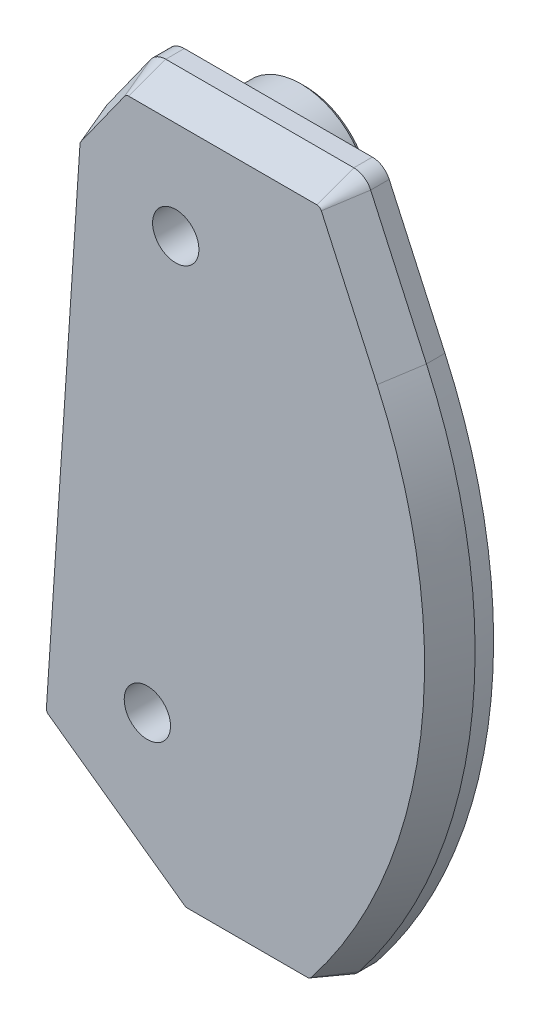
ISO-10303-21;
HEADER;
FILE_DESCRIPTION(('STEP AP214'),'2;1');
FILE_NAME('part.step','',(''),(''),'','','');
FILE_SCHEMA(('AUTOMOTIVE_DESIGN { 1 0 10303 214 1 1 1 1 }'));
ENDSEC;
DATA;
#1=APPLICATION_CONTEXT('core data for automotive mechanical design processes');
#2=APPLICATION_PROTOCOL_DEFINITION('international standard','automotive_design',2000,#1);
#3=PRODUCT_CONTEXT('',#1,'mechanical');
#4=PRODUCT('Part','Part','',(#3));
#5=PRODUCT_RELATED_PRODUCT_CATEGORY('part','',(#4));
#6=PRODUCT_DEFINITION_FORMATION('','',#4);
#7=PRODUCT_DEFINITION_CONTEXT('part definition',#1,'design');
#8=PRODUCT_DEFINITION('design','',#6,#7);
#9=PRODUCT_DEFINITION_SHAPE('','',#8);
#10=(LENGTH_UNIT() NAMED_UNIT(*) SI_UNIT(.MILLI.,.METRE.));
#11=(NAMED_UNIT(*) PLANE_ANGLE_UNIT() SI_UNIT($,.RADIAN.));
#12=(NAMED_UNIT(*) SI_UNIT($,.STERADIAN.) SOLID_ANGLE_UNIT());
#13=UNCERTAINTY_MEASURE_WITH_UNIT(LENGTH_MEASURE(1.E-05),#10,'distance_accuracy_value','');
#14=(GEOMETRIC_REPRESENTATION_CONTEXT(3) GLOBAL_UNCERTAINTY_ASSIGNED_CONTEXT((#13)) GLOBAL_UNIT_ASSIGNED_CONTEXT((#10,
#11,#12)) REPRESENTATION_CONTEXT('',''));
#15=CARTESIAN_POINT('',(0.,0.,0.));
#16=DIRECTION('',(0.,0.,1.));
#17=DIRECTION('',(1.,0.,0.));
#18=AXIS2_PLACEMENT_3D('',#15,#16,#17);
#19=CARTESIAN_POINT('',(-61.9612255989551,13.1120632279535,6.));
#20=DIRECTION('',(0.,0.,-1.));
#21=DIRECTION('',(-1.,0.,0.));
#22=AXIS2_PLACEMENT_3D('',#19,#20,#21);
#23=CYLINDRICAL_SURFACE('',#22,58.581585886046);
#24=DIRECTION('',(0.,0.,1.));
#25=VECTOR('',#24,1.);
#26=CARTESIAN_POINT('',(-8.63233537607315,37.3573034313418,-112.384243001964));
#27=LINE('',#26,#25);
#28=CARTESIAN_POINT('',(-8.63233537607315,37.3573034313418,0.));
#29=VERTEX_POINT('',#28);
#30=CARTESIAN_POINT('',(-8.63233537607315,37.3573034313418,1.99999999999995));
#31=VERTEX_POINT('',#30);
#32=EDGE_CURVE('E221',#29,#31,#27,.T.);
#33=ORIENTED_EDGE('',*,*,#32,.T.);
#34=CARTESIAN_POINT('',(-61.9612255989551,13.1120632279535,1.99999999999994));
#35=DIRECTION('',(0.,0.,1.));
#36=DIRECTION('',(1.,0.,0.));
#37=AXIS2_PLACEMENT_3D('',#34,#35,#36);
#38=CIRCLE('',#37,58.581585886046);
#39=CARTESIAN_POINT('',(-15.9322016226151,-23.1250883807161,1.99999999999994));
#40=VERTEX_POINT('',#39);
#41=EDGE_CURVE('E11',#31,#40,#38,.F.);
#42=ORIENTED_EDGE('',*,*,#41,.T.);
#43=DIRECTION('',(0.,0.,-1.));
#44=VECTOR('',#43,1.);
#45=CARTESIAN_POINT('',(-15.9322016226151,-23.1250883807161,6.));
#46=LINE('',#45,#44);
#47=CARTESIAN_POINT('',(-15.9322016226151,-23.1250883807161,0.));
#48=VERTEX_POINT('',#47);
#49=EDGE_CURVE('E228',#40,#48,#46,.T.);
#50=ORIENTED_EDGE('',*,*,#49,.T.);
#51=CARTESIAN_POINT('',(-61.9612255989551,13.1120632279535,0.));
#52=DIRECTION('',(0.,0.,1.));
#53=DIRECTION('',(1.,0.,0.));
#54=AXIS2_PLACEMENT_3D('',#51,#52,#53);
#55=CIRCLE('',#54,58.581585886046);
#56=EDGE_CURVE('E215',#48,#29,#55,.T.);
#57=ORIENTED_EDGE('',*,*,#56,.T.);
#58=EDGE_LOOP('',(#33,#42,#50,#57));
#59=FACE_BOUND('',#58,.T.);
#60=ADVANCED_FACE('F40',(#59),#23,.T.);
#61=CARTESIAN_POINT('',(-33.5317549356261,-23.8879367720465,6.));
#62=DIRECTION('',(0.,1.,0.));
#63=DIRECTION('',(0.,0.,1.));
#64=AXIS2_PLACEMENT_3D('',#61,#62,#63);
#65=PLANE('',#64);
#66=DIRECTION('',(0.,0.,-1.));
#67=VECTOR('',#66,1.);
#68=CARTESIAN_POINT('',(-17.50365187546,-23.8879367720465,6.));
#69=LINE('',#68,#67);
#70=CARTESIAN_POINT('',(-17.50365187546,-23.8879367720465,0.));
#71=VERTEX_POINT('',#70);
#72=CARTESIAN_POINT('',(-17.50365187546,-23.8879367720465,1.99999999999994));
#73=VERTEX_POINT('',#72);
#74=EDGE_CURVE('E244',#71,#73,#69,.F.);
#75=ORIENTED_EDGE('',*,*,#74,.T.);
#76=DIRECTION('',(-1.,0.,0.));
#77=VECTOR('',#76,1.);
#78=CARTESIAN_POINT('',(-30.443365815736,-23.8879367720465,1.99999999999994));
#79=LINE('',#78,#77);
#80=CARTESIAN_POINT('',(-30.443365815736,-23.8879367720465,1.99999999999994));
#81=VERTEX_POINT('',#80);
#82=EDGE_CURVE('E382',#73,#81,#79,.T.);
#83=ORIENTED_EDGE('',*,*,#82,.T.);
#84=DIRECTION('',(0.,0.,-1.));
#85=VECTOR('',#84,1.);
#86=CARTESIAN_POINT('',(-30.443365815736,-23.8879367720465,0.));
#87=LINE('',#86,#85);
#88=CARTESIAN_POINT('',(-30.443365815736,-23.8879367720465,0.));
#89=VERTEX_POINT('',#88);
#90=EDGE_CURVE('E300',#81,#89,#87,.T.);
#91=ORIENTED_EDGE('',*,*,#90,.T.);
#92=DIRECTION('',(1.,0.,0.));
#93=VECTOR('',#92,1.);
#94=CARTESIAN_POINT('',(-33.5317549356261,-23.8879367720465,0.));
#95=LINE('',#94,#93);
#96=EDGE_CURVE('E231',#89,#71,#95,.T.);
#97=ORIENTED_EDGE('',*,*,#96,.T.);
#98=EDGE_LOOP('',(#75,#83,#91,#97));
#99=FACE_BOUND('',#98,.T.);
#100=ADVANCED_FACE('F542',(#99),#65,.F.);
#101=CARTESIAN_POINT('',(-61.9612255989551,13.1120632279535,6.));
#102=DIRECTION('',(0.,0.,1.));
#103=DIRECTION('',(1.,0.,0.));
#104=AXIS2_PLACEMENT_3D('',#101,#102,#103);
#105=PLANE('',#104);
#106=CARTESIAN_POINT('',(-41.4946582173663,43.1755223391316,6.));
#107=DIRECTION('',(0.,0.,1.));
#108=DIRECTION('',(1.,0.,0.));
#109=AXIS2_PLACEMENT_3D('',#106,#107,#108);
#110=CIRCLE('',#109,0.544119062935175);
#111=CARTESIAN_POINT('',(-41.9373484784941,43.4918937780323,6.));
#112=VERTEX_POINT('',#111);
#113=CARTESIAN_POINT('',(-42.0375789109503,43.2116149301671,6.));
#114=VERTEX_POINT('',#113);
#115=EDGE_CURVE('E350',#112,#114,#110,.T.);
#116=ORIENTED_EDGE('',*,*,#115,.T.);
#117=DIRECTION('',(-0.0663321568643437,-0.997797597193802,0.));
#118=VECTOR('',#117,1.);
#119=CARTESIAN_POINT('',(-45.6655046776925,-11.3612466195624,6.));
#120=LINE('',#119,#118);
#121=CARTESIAN_POINT('',(-45.6655046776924,-11.3612466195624,6.));
#122=VERTEX_POINT('',#121);
#123=EDGE_CURVE('E353',#114,#122,#120,.T.);
#124=ORIENTED_EDGE('',*,*,#123,.T.);
#125=CARTESIAN_POINT('',(-45.1225839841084,-11.3973392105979,6.));
#126=DIRECTION('',(0.,0.,1.));
#127=DIRECTION('',(1.,0.,0.));
#128=AXIS2_PLACEMENT_3D('',#125,#126,#127);
#129=CIRCLE('',#128,0.544119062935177);
#130=CARTESIAN_POINT('',(-45.438955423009,-11.8400294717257,6.));
#131=VERTEX_POINT('',#130);
#132=EDGE_CURVE('E347',#122,#131,#129,.T.);
#133=ORIENTED_EDGE('',*,*,#132,.T.);
#134=DIRECTION('',(0.813590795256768,-0.581437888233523,0.));
#135=VECTOR('',#134,1.);
#136=CARTESIAN_POINT('',(-68.1791916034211,4.41142639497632,6.));
#137=LINE('',#136,#135);
#138=CARTESIAN_POINT('',(-30.7597372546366,-22.3306270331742,6.));
#139=VERTEX_POINT('',#138);
#140=EDGE_CURVE('E341',#131,#139,#137,.T.);
#141=ORIENTED_EDGE('',*,*,#140,.T.);
#142=CARTESIAN_POINT('',(-30.443365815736,-21.8879367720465,6.));
#143=DIRECTION('',(0.,0.,1.));
#144=DIRECTION('',(1.,0.,0.));
#145=AXIS2_PLACEMENT_3D('',#142,#143,#144);
#146=CIRCLE('',#145,0.544119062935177);
#147=CARTESIAN_POINT('',(-30.443365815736,-22.4320558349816,6.));
#148=VERTEX_POINT('',#147);
#149=EDGE_CURVE('E335',#139,#148,#146,.T.);
#150=ORIENTED_EDGE('',*,*,#149,.T.);
#151=DIRECTION('',(1.,0.,0.));
#152=VECTOR('',#151,1.);
#153=CARTESIAN_POINT('',(-17.50365187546,-22.4320558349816,6.));
#154=LINE('',#153,#152);
#155=CARTESIAN_POINT('',(-17.50365187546,-22.4320558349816,6.));
#156=VERTEX_POINT('',#155);
#157=EDGE_CURVE('E329',#148,#156,#154,.T.);
#158=ORIENTED_EDGE('',*,*,#157,.T.);
#159=CARTESIAN_POINT('',(-17.50365187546,-21.8879367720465,6.));
#160=DIRECTION('',(0.,0.,1.));
#161=DIRECTION('',(1.,0.,0.));
#162=AXIS2_PLACEMENT_3D('',#159,#160,#161);
#163=CIRCLE('',#162,0.544119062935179);
#164=CARTESIAN_POINT('',(-17.0761238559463,-22.2245156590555,6.));
#165=VERTEX_POINT('',#164);
#166=EDGE_CURVE('E324',#156,#165,#163,.T.);
#167=ORIENTED_EDGE('',*,*,#166,.T.);
#168=CARTESIAN_POINT('',(-61.9612255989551,13.1120632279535,6.));
#169=DIRECTION('',(0.,0.,1.));
#170=DIRECTION('',(1.,0.,0.));
#171=AXIS2_PLACEMENT_3D('',#168,#169,#170);
#172=CIRCLE('',#171,57.1257049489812);
#173=CARTESIAN_POINT('',(-9.95767530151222,36.7547560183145,6.));
#174=VERTEX_POINT('',#173);
#175=EDGE_CURVE('E319',#165,#174,#172,.T.);
#176=ORIENTED_EDGE('',*,*,#175,.T.);
#177=DIRECTION('',(-0.413871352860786,0.910335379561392,0.));
#178=VECTOR('',#177,1.);
#179=CARTESIAN_POINT('',(-9.95767530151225,36.7547560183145,6.));
#180=LINE('',#179,#178);
#181=CARTESIAN_POINT('',(-15.979245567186,49.9995684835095,6.));
#182=VERTEX_POINT('',#181);
#183=EDGE_CURVE('E321',#174,#182,#180,.T.);
#184=ORIENTED_EDGE('',*,*,#183,.T.);
#185=CARTESIAN_POINT('',(-16.4745764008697,49.7743731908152,6.));
#186=DIRECTION('',(0.,0.,1.));
#187=DIRECTION('',(1.,0.,0.));
#188=AXIS2_PLACEMENT_3D('',#185,#186,#187);
#189=CIRCLE('',#188,0.544119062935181);
#190=CARTESIAN_POINT('',(-16.4745764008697,50.3184922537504,6.));
#191=VERTEX_POINT('',#190);
#192=EDGE_CURVE('E326',#182,#191,#189,.T.);
#193=ORIENTED_EDGE('',*,*,#192,.T.);
#194=DIRECTION('',(-1.,0.,0.));
#195=VECTOR('',#194,1.);
#196=CARTESIAN_POINT('',(-36.7787470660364,50.3184922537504,6.));
#197=LINE('',#196,#195);
#198=CARTESIAN_POINT('',(-36.7787470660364,50.3184922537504,6.));
#199=VERTEX_POINT('',#198);
#200=EDGE_CURVE('E332',#191,#199,#197,.T.);
#201=ORIENTED_EDGE('',*,*,#200,.T.);
#202=CARTESIAN_POINT('',(-36.7787470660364,49.7743731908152,6.));
#203=DIRECTION('',(0.,0.,1.));
#204=DIRECTION('',(1.,0.,0.));
#205=AXIS2_PLACEMENT_3D('',#202,#203,#204);
#206=CIRCLE('',#205,0.544119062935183);
#207=CARTESIAN_POINT('',(-37.2214373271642,50.0907446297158,6.));
#208=VERTEX_POINT('',#207);
#209=EDGE_CURVE('E338',#199,#208,#206,.T.);
#210=ORIENTED_EDGE('',*,*,#209,.T.);
#211=DIRECTION('',(-0.581437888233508,-0.813590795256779,0.));
#212=VECTOR('',#211,1.);
#213=CARTESIAN_POINT('',(-63.0780761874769,13.910227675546,6.));
#214=LINE('',#213,#212);
#215=EDGE_CURVE('E344',#208,#112,#214,.T.);
#216=ORIENTED_EDGE('',*,*,#215,.T.);
#217=EDGE_LOOP('',(#116,#124,#133,#141,#150,#158,#167,#176,#184,#193,#201,#210,#216));
#218=FACE_BOUND('',#217,.T.);
#219=CARTESIAN_POINT('',(-31.6990027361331,39.7696554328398,6.));
#220=DIRECTION('',(0.,0.,-1.));
#221=DIRECTION('',(-1.,0.,0.));
#222=AXIS2_PLACEMENT_3D('',#219,#220,#221);
#223=CIRCLE('',#222,2.5);
#224=CARTESIAN_POINT('',(-34.1990027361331,39.7696554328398,6.));
#225=VERTEX_POINT('',#224);
#226=EDGE_CURVE('E445',#225,#225,#223,.T.);
#227=ORIENTED_EDGE('',*,*,#226,.T.);
#228=EDGE_LOOP('',(#227));
#229=FACE_BOUND('',#228,.T.);
#230=CARTESIAN_POINT('',(-34.7633159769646,-6.32509759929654,6.));
#231=DIRECTION('',(0.,0.,-1.));
#232=DIRECTION('',(-1.,0.,0.));
#233=AXIS2_PLACEMENT_3D('',#230,#231,#232);
#234=CIRCLE('',#233,2.5);
#235=CARTESIAN_POINT('',(-37.2633159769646,-6.32509759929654,6.));
#236=VERTEX_POINT('',#235);
#237=EDGE_CURVE('E457',#236,#236,#234,.T.);
#238=ORIENTED_EDGE('',*,*,#237,.T.);
#239=EDGE_LOOP('',(#238));
#240=FACE_BOUND('',#239,.T.);
#241=ADVANCED_FACE('F503',(#218,#229,#240),#105,.T.);
#242=CARTESIAN_POINT('',(-61.9612255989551,13.1120632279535,0.));
#243=DIRECTION('',(0.,0.,1.));
#244=DIRECTION('',(1.,0.,0.));
#245=AXIS2_PLACEMENT_3D('',#242,#243,#244);
#246=PLANE('',#245);
#247=CARTESIAN_POINT('',(-31.6990027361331,39.7696554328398,0.));
#248=DIRECTION('',(0.,0.,1.));
#249=DIRECTION('',(1.,0.,0.));
#250=AXIS2_PLACEMENT_3D('',#247,#248,#249);
#251=CIRCLE('',#250,7.5);
#252=CARTESIAN_POINT('',(-24.1990027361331,39.7696554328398,0.));
#253=VERTEX_POINT('',#252);
#254=EDGE_CURVE('E251',#253,#253,#251,.F.);
#255=ORIENTED_EDGE('',*,*,#254,.F.);
#256=EDGE_LOOP('',(#255));
#257=FACE_BOUND('',#256,.T.);
#258=CARTESIAN_POINT('',(-34.7633159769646,-6.32509759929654,0.));
#259=DIRECTION('',(0.,0.,1.));
#260=DIRECTION('',(1.,0.,0.));
#261=AXIS2_PLACEMENT_3D('',#258,#259,#260);
#262=CIRCLE('',#261,6.99999999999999);
#263=CARTESIAN_POINT('',(-27.7633159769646,-6.32509759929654,0.));
#264=VERTEX_POINT('',#263);
#265=EDGE_CURVE('E247',#264,#264,#262,.F.);
#266=ORIENTED_EDGE('',*,*,#265,.F.);
#267=EDGE_LOOP('',(#266));
#268=FACE_BOUND('',#267,.T.);
#269=DIRECTION('',(-1.,0.,0.));
#270=VECTOR('',#269,1.);
#271=CARTESIAN_POINT('',(-15.1868561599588,51.7743731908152,0.));
#272=LINE('',#271,#270);
#273=CARTESIAN_POINT('',(-16.4745764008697,51.7743731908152,0.));
#274=VERTEX_POINT('',#273);
#275=CARTESIAN_POINT('',(-36.7787470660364,51.7743731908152,0.));
#276=VERTEX_POINT('',#275);
#277=EDGE_CURVE('E461',#274,#276,#272,.T.);
#278=ORIENTED_EDGE('',*,*,#277,.F.);
#279=CARTESIAN_POINT('',(-16.4745764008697,49.7743731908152,0.));
#280=DIRECTION('',(0.,0.,1.));
#281=DIRECTION('',(1.,0.,0.));
#282=AXIS2_PLACEMENT_3D('',#279,#280,#281);
#283=CIRCLE('',#282,2.);
#284=CARTESIAN_POINT('',(-14.6539056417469,50.6021158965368,0.));
#285=VERTEX_POINT('',#284);
#286=EDGE_CURVE('E217',#274,#285,#283,.F.);
#287=ORIENTED_EDGE('',*,*,#286,.T.);
#288=DIRECTION('',(0.413871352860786,-0.910335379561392,0.));
#289=VECTOR('',#288,1.);
#290=CARTESIAN_POINT('',(-8.63233537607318,37.3573034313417,0.));
#291=LINE('',#290,#289);
#292=EDGE_CURVE('E210',#285,#29,#291,.T.);
#293=ORIENTED_EDGE('',*,*,#292,.T.);
#294=ORIENTED_EDGE('',*,*,#56,.F.);
#295=CARTESIAN_POINT('',(-17.50365187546,-21.8879367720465,0.));
#296=DIRECTION('',(0.,0.,1.));
#297=DIRECTION('',(1.,0.,0.));
#298=AXIS2_PLACEMENT_3D('',#295,#296,#297);
#299=CIRCLE('',#298,2.);
#300=EDGE_CURVE('E242',#48,#71,#299,.F.);
#301=ORIENTED_EDGE('',*,*,#300,.T.);
#302=ORIENTED_EDGE('',*,*,#96,.F.);
#303=CARTESIAN_POINT('',(-30.443365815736,-21.8879367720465,0.));
#304=DIRECTION('',(0.,0.,1.));
#305=DIRECTION('',(1.,0.,0.));
#306=AXIS2_PLACEMENT_3D('',#303,#304,#305);
#307=CIRCLE('',#306,2.);
#308=CARTESIAN_POINT('',(-31.606241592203,-23.51511836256,0.));
#309=VERTEX_POINT('',#308);
#310=EDGE_CURVE('E262',#89,#309,#307,.F.);
#311=ORIENTED_EDGE('',*,*,#310,.T.);
#312=DIRECTION('',(-0.813590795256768,0.581437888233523,0.));
#313=VECTOR('',#312,1.);
#314=CARTESIAN_POINT('',(-71.3270378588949,4.87160385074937,0.));
#315=LINE('',#314,#313);
#316=CARTESIAN_POINT('',(-46.2854597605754,-13.0245208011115,0.));
#317=VERTEX_POINT('',#316);
#318=EDGE_CURVE('E232',#309,#317,#315,.T.);
#319=ORIENTED_EDGE('',*,*,#318,.T.);
#320=CARTESIAN_POINT('',(-45.1225839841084,-11.3973392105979,0.));
#321=DIRECTION('',(0.,0.,1.));
#322=DIRECTION('',(1.,0.,0.));
#323=AXIS2_PLACEMENT_3D('',#320,#321,#322);
#324=CIRCLE('',#323,2.);
#325=CARTESIAN_POINT('',(-47.118179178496,-11.2646748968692,0.));
#326=VERTEX_POINT('',#325);
#327=EDGE_CURVE('E265',#317,#326,#324,.F.);
#328=ORIENTED_EDGE('',*,*,#327,.T.);
#329=DIRECTION('',(-0.0663321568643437,-0.997797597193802,0.));
#330=VECTOR('',#329,1.);
#331=CARTESIAN_POINT('',(-43.4525275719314,43.8756753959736,0.));
#332=LINE('',#331,#330);
#333=CARTESIAN_POINT('',(-43.4902534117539,43.3081866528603,0.));
#334=VERTEX_POINT('',#333);
#335=EDGE_CURVE('E226',#334,#326,#332,.T.);
#336=ORIENTED_EDGE('',*,*,#335,.F.);
#337=CARTESIAN_POINT('',(-41.4946582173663,43.1755223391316,0.));
#338=DIRECTION('',(0.,0.,1.));
#339=DIRECTION('',(1.,0.,0.));
#340=AXIS2_PLACEMENT_3D('',#337,#338,#339);
#341=CIRCLE('',#340,2.);
#342=CARTESIAN_POINT('',(-43.1218398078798,44.3383981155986,0.));
#343=VERTEX_POINT('',#342);
#344=EDGE_CURVE('E268',#334,#343,#341,.F.);
#345=ORIENTED_EDGE('',*,*,#344,.T.);
#346=DIRECTION('',(0.581437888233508,0.813590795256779,0.));
#347=VECTOR('',#346,1.);
#348=CARTESIAN_POINT('',(-23.9821232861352,71.120101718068,0.));
#349=LINE('',#348,#347);
#350=CARTESIAN_POINT('',(-38.40592865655,50.9372489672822,0.));
#351=VERTEX_POINT('',#350);
#352=EDGE_CURVE('E220',#343,#351,#349,.T.);
#353=ORIENTED_EDGE('',*,*,#352,.T.);
#354=CARTESIAN_POINT('',(-36.7787470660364,49.7743731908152,0.));
#355=DIRECTION('',(0.,0.,1.));
#356=DIRECTION('',(1.,0.,0.));
#357=AXIS2_PLACEMENT_3D('',#354,#355,#356);
#358=CIRCLE('',#357,2.);
#359=EDGE_CURVE('E271',#351,#276,#358,.F.);
#360=ORIENTED_EDGE('',*,*,#359,.T.);
#361=EDGE_LOOP('',(#278,#287,#293,#294,#301,#302,#311,#319,#328,#336,#345,#353,#360));
#362=FACE_BOUND('',#361,.T.);
#363=ADVANCED_FACE('F212',(#257,#268,#362),#246,.F.);
#364=CARTESIAN_POINT('',(-17.50365187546,-21.8879367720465,6.));
#365=DIRECTION('',(0.,0.,-1.));
#366=DIRECTION('',(-1.,0.,0.));
#367=AXIS2_PLACEMENT_3D('',#364,#365,#366);
#368=CYLINDRICAL_SURFACE('',#367,2.);
#369=ORIENTED_EDGE('',*,*,#49,.F.);
#370=CARTESIAN_POINT('',(-17.50365187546,-21.8879367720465,1.99999999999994));
#371=DIRECTION('',(0.,0.,1.));
#372=DIRECTION('',(1.,0.,0.));
#373=AXIS2_PLACEMENT_3D('',#370,#371,#372);
#374=CIRCLE('',#373,2.);
#375=EDGE_CURVE('E388',#40,#73,#374,.F.);
#376=ORIENTED_EDGE('',*,*,#375,.T.);
#377=ORIENTED_EDGE('',*,*,#74,.F.);
#378=ORIENTED_EDGE('',*,*,#300,.F.);
#379=EDGE_LOOP('',(#369,#376,#377,#378));
#380=FACE_BOUND('',#379,.T.);
#381=ADVANCED_FACE('F540',(#380),#368,.T.);
#382=CARTESIAN_POINT('',(-23.9821232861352,71.120101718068,-112.384243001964));
#383=DIRECTION('',(-0.813590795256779,0.581437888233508,0.));
#384=DIRECTION('',(-0.581437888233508,-0.813590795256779,0.));
#385=AXIS2_PLACEMENT_3D('',#382,#383,#384);
#386=PLANE('',#385);
#387=DIRECTION('',(0.,0.,-1.));
#388=VECTOR('',#387,1.);
#389=CARTESIAN_POINT('',(-43.1218398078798,44.3383981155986,6.));
#390=LINE('',#389,#388);
#391=CARTESIAN_POINT('',(-43.1218398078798,44.3383981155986,1.99999999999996));
#392=VERTEX_POINT('',#391);
#393=EDGE_CURVE('E279',#343,#392,#390,.F.);
#394=ORIENTED_EDGE('',*,*,#393,.T.);
#395=DIRECTION('',(0.581437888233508,0.813590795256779,0.));
#396=VECTOR('',#395,1.);
#397=CARTESIAN_POINT('',(-23.9821232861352,71.120101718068,1.99999999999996));
#398=LINE('',#397,#396);
#399=CARTESIAN_POINT('',(-38.40592865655,50.9372489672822,2.00000000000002));
#400=VERTEX_POINT('',#399);
#401=EDGE_CURVE('E367',#392,#400,#398,.T.);
#402=ORIENTED_EDGE('',*,*,#401,.T.);
#403=DIRECTION('',(0.,0.,-1.));
#404=VECTOR('',#403,1.);
#405=CARTESIAN_POINT('',(-38.40592865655,50.9372489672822,0.));
#406=LINE('',#405,#404);
#407=EDGE_CURVE('E283',#400,#351,#406,.T.);
#408=ORIENTED_EDGE('',*,*,#407,.T.);
#409=ORIENTED_EDGE('',*,*,#352,.F.);
#410=EDGE_LOOP('',(#394,#402,#408,#409));
#411=FACE_BOUND('',#410,.T.);
#412=ADVANCED_FACE('F476',(#411),#386,.T.);
#413=CARTESIAN_POINT('',(-8.63233537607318,37.3573034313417,-112.384243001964));
#414=DIRECTION('',(0.910335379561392,0.413871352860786,0.));
#415=DIRECTION('',(-0.413871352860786,0.910335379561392,0.));
#416=AXIS2_PLACEMENT_3D('',#413,#414,#415);
#417=PLANE('',#416);
#418=DIRECTION('',(0.,0.,-1.));
#419=VECTOR('',#418,1.);
#420=CARTESIAN_POINT('',(-14.6539056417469,50.6021158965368,6.));
#421=LINE('',#420,#419);
#422=CARTESIAN_POINT('',(-14.6539056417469,50.6021158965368,1.99999999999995));
#423=VERTEX_POINT('',#422);
#424=EDGE_CURVE('E276',#285,#423,#421,.F.);
#425=ORIENTED_EDGE('',*,*,#424,.T.);
#426=DIRECTION('',(0.413871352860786,-0.910335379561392,0.));
#427=VECTOR('',#426,1.);
#428=CARTESIAN_POINT('',(-8.63233537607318,37.3573034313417,1.99999999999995));
#429=LINE('',#428,#427);
#430=EDGE_CURVE('E51',#423,#31,#429,.T.);
#431=ORIENTED_EDGE('',*,*,#430,.T.);
#432=ORIENTED_EDGE('',*,*,#32,.F.);
#433=ORIENTED_EDGE('',*,*,#292,.F.);
#434=EDGE_LOOP('',(#425,#431,#432,#433));
#435=FACE_BOUND('',#434,.T.);
#436=ADVANCED_FACE('F223',(#435),#417,.T.);
#437=CARTESIAN_POINT('',(-71.3270378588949,4.87160385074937,-112.384243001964));
#438=DIRECTION('',(-0.581437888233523,-0.813590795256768,0.));
#439=DIRECTION('',(0.813590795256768,-0.581437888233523,0.));
#440=AXIS2_PLACEMENT_3D('',#437,#438,#439);
#441=PLANE('',#440);
#442=DIRECTION('',(0.,0.,-1.));
#443=VECTOR('',#442,1.);
#444=CARTESIAN_POINT('',(-31.606241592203,-23.51511836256,6.));
#445=LINE('',#444,#443);
#446=CARTESIAN_POINT('',(-31.606241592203,-23.51511836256,1.99999999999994));
#447=VERTEX_POINT('',#446);
#448=EDGE_CURVE('E293',#309,#447,#445,.F.);
#449=ORIENTED_EDGE('',*,*,#448,.T.);
#450=DIRECTION('',(-0.813590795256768,0.581437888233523,0.));
#451=VECTOR('',#450,1.);
#452=CARTESIAN_POINT('',(-71.3270378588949,4.87160385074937,1.99999999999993));
#453=LINE('',#452,#451);
#454=CARTESIAN_POINT('',(-46.2854597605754,-13.0245208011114,1.99999999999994));
#455=VERTEX_POINT('',#454);
#456=EDGE_CURVE('E370',#447,#455,#453,.T.);
#457=ORIENTED_EDGE('',*,*,#456,.T.);
#458=DIRECTION('',(0.,0.,-1.));
#459=VECTOR('',#458,1.);
#460=CARTESIAN_POINT('',(-46.2854597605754,-13.0245208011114,0.));
#461=LINE('',#460,#459);
#462=EDGE_CURVE('E297',#455,#317,#461,.T.);
#463=ORIENTED_EDGE('',*,*,#462,.T.);
#464=ORIENTED_EDGE('',*,*,#318,.F.);
#465=EDGE_LOOP('',(#449,#457,#463,#464));
#466=FACE_BOUND('',#465,.T.);
#467=ADVANCED_FACE('F550',(#466),#441,.T.);
#468=CARTESIAN_POINT('',(-34.7633159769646,-6.32509759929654,-8.));
#469=DIRECTION('',(0.,0.,1.));
#470=DIRECTION('',(1.,0.,0.));
#471=AXIS2_PLACEMENT_3D('',#468,#469,#470);
#472=CYLINDRICAL_SURFACE('',#471,6.99999999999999);
#473=CARTESIAN_POINT('',(-34.7633159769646,-6.32509759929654,-7.50000000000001));
#474=DIRECTION('',(0.,0.,-1.));
#475=DIRECTION('',(-1.,0.,0.));
#476=AXIS2_PLACEMENT_3D('',#473,#474,#475);
#477=CIRCLE('',#476,6.99999999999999);
#478=CARTESIAN_POINT('',(-41.7633159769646,-6.32509759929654,-7.50000000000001));
#479=VERTEX_POINT('',#478);
#480=EDGE_CURVE('E315',#479,#479,#477,.F.);
#481=ORIENTED_EDGE('',*,*,#480,.T.);
#482=EDGE_LOOP('',(#481));
#483=FACE_BOUND('',#482,.T.);
#484=ORIENTED_EDGE('',*,*,#265,.T.);
#485=EDGE_LOOP('',(#484));
#486=FACE_BOUND('',#485,.T.);
#487=ADVANCED_FACE('F796',(#483,#486),#472,.T.);
#488=CARTESIAN_POINT('',(-34.7633159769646,-6.32509759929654,-8.));
#489=DIRECTION('',(0.,0.,-1.));
#490=DIRECTION('',(-1.,0.,0.));
#491=AXIS2_PLACEMENT_3D('',#488,#489,#490);
#492=PLANE('',#491);
#493=CARTESIAN_POINT('',(-34.7633159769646,-6.32509759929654,-8.));
#494=DIRECTION('',(0.,0.,-1.));
#495=DIRECTION('',(-1.,0.,0.));
#496=AXIS2_PLACEMENT_3D('',#493,#494,#495);
#497=CIRCLE('',#496,6.50000000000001);
#498=CARTESIAN_POINT('',(-41.2633159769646,-6.32509759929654,-8.));
#499=VERTEX_POINT('',#498);
#500=EDGE_CURVE('E311',#499,#499,#497,.T.);
#501=ORIENTED_EDGE('',*,*,#500,.T.);
#502=EDGE_LOOP('',(#501));
#503=FACE_BOUND('',#502,.T.);
#504=CARTESIAN_POINT('',(-34.7633159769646,-6.32509759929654,-8.));
#505=DIRECTION('',(0.,0.,-1.));
#506=DIRECTION('',(-1.,0.,0.));
#507=AXIS2_PLACEMENT_3D('',#504,#505,#506);
#508=CIRCLE('',#507,2.5);
#509=CARTESIAN_POINT('',(-37.2633159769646,-6.32509759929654,-8.));
#510=VERTEX_POINT('',#509);
#511=EDGE_CURVE('E451',#510,#510,#508,.T.);
#512=ORIENTED_EDGE('',*,*,#511,.F.);
#513=EDGE_LOOP('',(#512));
#514=FACE_BOUND('',#513,.T.);
#515=ADVANCED_FACE('F789',(#503,#514),#492,.T.);
#516=CARTESIAN_POINT('',(-31.6990027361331,39.7696554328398,-8.));
#517=DIRECTION('',(0.,0.,1.));
#518=DIRECTION('',(1.,0.,0.));
#519=AXIS2_PLACEMENT_3D('',#516,#517,#518);
#520=CYLINDRICAL_SURFACE('',#519,7.5);
#521=CARTESIAN_POINT('',(-31.6990027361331,39.7696554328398,-7.5));
#522=DIRECTION('',(0.,0.,-1.));
#523=DIRECTION('',(-1.,0.,0.));
#524=AXIS2_PLACEMENT_3D('',#521,#522,#523);
#525=CIRCLE('',#524,7.5);
#526=CARTESIAN_POINT('',(-39.1990027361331,39.7696554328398,-7.5));
#527=VERTEX_POINT('',#526);
#528=EDGE_CURVE('E307',#527,#527,#525,.F.);
#529=ORIENTED_EDGE('',*,*,#528,.T.);
#530=EDGE_LOOP('',(#529));
#531=FACE_BOUND('',#530,.T.);
#532=ORIENTED_EDGE('',*,*,#254,.T.);
#533=EDGE_LOOP('',(#532));
#534=FACE_BOUND('',#533,.T.);
#535=ADVANCED_FACE('F782',(#531,#534),#520,.T.);
#536=CARTESIAN_POINT('',(-31.6990027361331,39.7696554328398,-8.));
#537=DIRECTION('',(0.,0.,-1.));
#538=DIRECTION('',(-1.,0.,0.));
#539=AXIS2_PLACEMENT_3D('',#536,#537,#538);
#540=PLANE('',#539);
#541=CARTESIAN_POINT('',(-31.6990027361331,39.7696554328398,-8.));
#542=DIRECTION('',(0.,0.,-1.));
#543=DIRECTION('',(-1.,0.,0.));
#544=AXIS2_PLACEMENT_3D('',#541,#542,#543);
#545=CIRCLE('',#544,7.00000000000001);
#546=CARTESIAN_POINT('',(-38.6990027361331,39.7696554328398,-8.));
#547=VERTEX_POINT('',#546);
#548=EDGE_CURVE('E303',#547,#547,#545,.T.);
#549=ORIENTED_EDGE('',*,*,#548,.T.);
#550=EDGE_LOOP('',(#549));
#551=FACE_BOUND('',#550,.T.);
#552=CARTESIAN_POINT('',(-31.6990027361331,39.7696554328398,-8.));
#553=DIRECTION('',(0.,0.,-1.));
#554=DIRECTION('',(-1.,0.,0.));
#555=AXIS2_PLACEMENT_3D('',#552,#553,#554);
#556=CIRCLE('',#555,2.5);
#557=CARTESIAN_POINT('',(-34.1990027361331,39.7696554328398,-8.));
#558=VERTEX_POINT('',#557);
#559=EDGE_CURVE('E440',#558,#558,#556,.T.);
#560=ORIENTED_EDGE('',*,*,#559,.F.);
#561=EDGE_LOOP('',(#560));
#562=FACE_BOUND('',#561,.T.);
#563=ADVANCED_FACE('F779',(#551,#562),#540,.T.);
#564=CARTESIAN_POINT('',(-43.4525275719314,43.8756753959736,6.));
#565=DIRECTION('',(0.997797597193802,-0.0663321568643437,0.));
#566=DIRECTION('',(0.0663321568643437,0.997797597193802,0.));
#567=AXIS2_PLACEMENT_3D('',#564,#565,#566);
#568=PLANE('',#567);
#569=DIRECTION('',(0.,0.,-1.));
#570=VECTOR('',#569,1.);
#571=CARTESIAN_POINT('',(-47.118179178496,-11.2646748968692,5.99999999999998));
#572=LINE('',#571,#570);
#573=CARTESIAN_POINT('',(-47.118179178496,-11.2646748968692,2.00000000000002));
#574=VERTEX_POINT('',#573);
#575=EDGE_CURVE('E286',#326,#574,#572,.F.);
#576=ORIENTED_EDGE('',*,*,#575,.T.);
#577=DIRECTION('',(0.0663321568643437,0.997797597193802,0.));
#578=VECTOR('',#577,1.);
#579=CARTESIAN_POINT('',(-43.4902534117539,43.3081866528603,1.99999999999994));
#580=LINE('',#579,#578);
#581=CARTESIAN_POINT('',(-43.4902534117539,43.3081866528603,1.99999999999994));
#582=VERTEX_POINT('',#581);
#583=EDGE_CURVE('E357',#574,#582,#580,.T.);
#584=ORIENTED_EDGE('',*,*,#583,.T.);
#585=DIRECTION('',(0.,0.,-1.));
#586=VECTOR('',#585,1.);
#587=CARTESIAN_POINT('',(-43.4902534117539,43.3081866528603,0.));
#588=LINE('',#587,#586);
#589=EDGE_CURVE('E290',#582,#334,#588,.T.);
#590=ORIENTED_EDGE('',*,*,#589,.T.);
#591=ORIENTED_EDGE('',*,*,#335,.T.);
#592=EDGE_LOOP('',(#576,#584,#590,#591));
#593=FACE_BOUND('',#592,.T.);
#594=ADVANCED_FACE('F491',(#593),#568,.F.);
#595=CARTESIAN_POINT('',(-15.1868561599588,51.7743731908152,6.));
#596=DIRECTION('',(0.,-1.,0.));
#597=DIRECTION('',(1.,0.,0.));
#598=AXIS2_PLACEMENT_3D('',#595,#596,#597);
#599=PLANE('',#598);
#600=DIRECTION('',(0.,0.,-1.));
#601=VECTOR('',#600,1.);
#602=CARTESIAN_POINT('',(-36.7787470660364,51.7743731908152,5.99999999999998));
#603=LINE('',#602,#601);
#604=CARTESIAN_POINT('',(-36.7787470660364,51.7743731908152,1.99999999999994));
#605=VERTEX_POINT('',#604);
#606=EDGE_CURVE('E255',#276,#605,#603,.F.);
#607=ORIENTED_EDGE('',*,*,#606,.T.);
#608=DIRECTION('',(1.,0.,0.));
#609=VECTOR('',#608,1.);
#610=CARTESIAN_POINT('',(-16.4745764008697,51.7743731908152,1.99999999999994));
#611=LINE('',#610,#609);
#612=CARTESIAN_POINT('',(-16.4745764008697,51.7743731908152,1.99999999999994));
#613=VERTEX_POINT('',#612);
#614=EDGE_CURVE('E379',#605,#613,#611,.T.);
#615=ORIENTED_EDGE('',*,*,#614,.T.);
#616=DIRECTION('',(0.,0.,-1.));
#617=VECTOR('',#616,1.);
#618=CARTESIAN_POINT('',(-16.4745764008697,51.7743731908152,0.));
#619=LINE('',#618,#617);
#620=EDGE_CURVE('E259',#613,#274,#619,.T.);
#621=ORIENTED_EDGE('',*,*,#620,.T.);
#622=ORIENTED_EDGE('',*,*,#277,.T.);
#623=EDGE_LOOP('',(#607,#615,#621,#622));
#624=FACE_BOUND('',#623,.T.);
#625=ADVANCED_FACE('F524',(#624),#599,.F.);
#626=CARTESIAN_POINT('',(-16.4745764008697,49.7743731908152,6.));
#627=DIRECTION('',(0.,0.,1.));
#628=DIRECTION('',(1.,0.,0.));
#629=AXIS2_PLACEMENT_3D('',#626,#627,#628);
#630=CYLINDRICAL_SURFACE('',#629,2.);
#631=ORIENTED_EDGE('',*,*,#620,.F.);
#632=CARTESIAN_POINT('',(-16.4745764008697,49.7743731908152,1.99999999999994));
#633=DIRECTION('',(0.,0.,1.));
#634=DIRECTION('',(1.,0.,0.));
#635=AXIS2_PLACEMENT_3D('',#632,#633,#634);
#636=CIRCLE('',#635,2.);
#637=EDGE_CURVE('E385',#613,#423,#636,.F.);
#638=ORIENTED_EDGE('',*,*,#637,.T.);
#639=ORIENTED_EDGE('',*,*,#424,.F.);
#640=ORIENTED_EDGE('',*,*,#286,.F.);
#641=EDGE_LOOP('',(#631,#638,#639,#640));
#642=FACE_BOUND('',#641,.T.);
#643=ADVANCED_FACE('F526',(#642),#630,.T.);
#644=CARTESIAN_POINT('',(-36.7787470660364,49.7743731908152,-112.384243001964));
#645=DIRECTION('',(0.,0.,1.));
#646=DIRECTION('',(1.,0.,0.));
#647=AXIS2_PLACEMENT_3D('',#644,#645,#646);
#648=CYLINDRICAL_SURFACE('',#647,2.);
#649=ORIENTED_EDGE('',*,*,#407,.F.);
#650=CARTESIAN_POINT('',(-36.7787470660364,49.7743731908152,2.00000000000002));
#651=DIRECTION('',(0.,0.,1.));
#652=DIRECTION('',(1.,0.,0.));
#653=AXIS2_PLACEMENT_3D('',#650,#651,#652);
#654=CIRCLE('',#653,2.);
#655=EDGE_CURVE('E373',#400,#605,#654,.F.);
#656=ORIENTED_EDGE('',*,*,#655,.T.);
#657=ORIENTED_EDGE('',*,*,#606,.F.);
#658=ORIENTED_EDGE('',*,*,#359,.F.);
#659=EDGE_LOOP('',(#649,#656,#657,#658));
#660=FACE_BOUND('',#659,.T.);
#661=ADVANCED_FACE('F512',(#660),#648,.T.);
#662=CARTESIAN_POINT('',(-41.4946582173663,43.1755223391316,6.));
#663=DIRECTION('',(0.,0.,1.));
#664=DIRECTION('',(1.,0.,0.));
#665=AXIS2_PLACEMENT_3D('',#662,#663,#664);
#666=CYLINDRICAL_SURFACE('',#665,2.);
#667=ORIENTED_EDGE('',*,*,#589,.F.);
#668=CARTESIAN_POINT('',(-41.4946582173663,43.1755223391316,1.99999999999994));
#669=DIRECTION('',(0.,0.,1.));
#670=DIRECTION('',(1.,0.,0.));
#671=AXIS2_PLACEMENT_3D('',#668,#669,#670);
#672=CIRCLE('',#671,2.);
#673=EDGE_CURVE('E361',#582,#392,#672,.F.);
#674=ORIENTED_EDGE('',*,*,#673,.T.);
#675=ORIENTED_EDGE('',*,*,#393,.F.);
#676=ORIENTED_EDGE('',*,*,#344,.F.);
#677=EDGE_LOOP('',(#667,#674,#675,#676));
#678=FACE_BOUND('',#677,.T.);
#679=ADVANCED_FACE('F481',(#678),#666,.T.);
#680=CARTESIAN_POINT('',(-45.1225839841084,-11.3973392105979,-112.384243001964));
#681=DIRECTION('',(0.,0.,1.));
#682=DIRECTION('',(1.,0.,0.));
#683=AXIS2_PLACEMENT_3D('',#680,#681,#682);
#684=CYLINDRICAL_SURFACE('',#683,2.);
#685=ORIENTED_EDGE('',*,*,#462,.F.);
#686=CARTESIAN_POINT('',(-45.1225839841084,-11.3973392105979,2.00000000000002));
#687=DIRECTION('',(0.,0.,1.));
#688=DIRECTION('',(1.,0.,0.));
#689=AXIS2_PLACEMENT_3D('',#686,#687,#688);
#690=CIRCLE('',#689,2.);
#691=EDGE_CURVE('E364',#455,#574,#690,.F.);
#692=ORIENTED_EDGE('',*,*,#691,.T.);
#693=ORIENTED_EDGE('',*,*,#575,.F.);
#694=ORIENTED_EDGE('',*,*,#327,.F.);
#695=EDGE_LOOP('',(#685,#692,#693,#694));
#696=FACE_BOUND('',#695,.T.);
#697=ADVANCED_FACE('F564',(#696),#684,.T.);
#698=CARTESIAN_POINT('',(-30.443365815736,-21.8879367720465,6.));
#699=DIRECTION('',(0.,0.,1.));
#700=DIRECTION('',(1.,0.,0.));
#701=AXIS2_PLACEMENT_3D('',#698,#699,#700);
#702=CYLINDRICAL_SURFACE('',#701,2.);
#703=ORIENTED_EDGE('',*,*,#90,.F.);
#704=CARTESIAN_POINT('',(-30.443365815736,-21.8879367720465,1.99999999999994));
#705=DIRECTION('',(0.,0.,1.));
#706=DIRECTION('',(1.,0.,0.));
#707=AXIS2_PLACEMENT_3D('',#704,#705,#706);
#708=CIRCLE('',#707,2.);
#709=EDGE_CURVE('E376',#81,#447,#708,.F.);
#710=ORIENTED_EDGE('',*,*,#709,.T.);
#711=ORIENTED_EDGE('',*,*,#448,.F.);
#712=ORIENTED_EDGE('',*,*,#310,.F.);
#713=EDGE_LOOP('',(#703,#710,#711,#712));
#714=FACE_BOUND('',#713,.T.);
#715=ADVANCED_FACE('F554',(#714),#702,.T.);
#716=CARTESIAN_POINT('',(-34.7633159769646,-6.32509759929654,-8.));
#717=DIRECTION('',(0.,0.,-1.));
#718=DIRECTION('',(-1.,0.,0.));
#719=AXIS2_PLACEMENT_3D('',#716,#717,#718);
#720=CYLINDRICAL_SURFACE('',#719,2.5);
#721=ORIENTED_EDGE('',*,*,#237,.F.);
#722=EDGE_LOOP('',(#721));
#723=FACE_BOUND('',#722,.T.);
#724=ORIENTED_EDGE('',*,*,#511,.T.);
#725=EDGE_LOOP('',(#724));
#726=FACE_BOUND('',#725,.T.);
#727=ADVANCED_FACE('F571',(#723,#726),#720,.F.);
#728=CARTESIAN_POINT('',(-31.6990027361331,39.7696554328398,-8.));
#729=DIRECTION('',(0.,0.,-1.));
#730=DIRECTION('',(-1.,0.,0.));
#731=AXIS2_PLACEMENT_3D('',#728,#729,#730);
#732=CYLINDRICAL_SURFACE('',#731,2.5);
#733=ORIENTED_EDGE('',*,*,#226,.F.);
#734=EDGE_LOOP('',(#733));
#735=FACE_BOUND('',#734,.T.);
#736=ORIENTED_EDGE('',*,*,#559,.T.);
#737=EDGE_LOOP('',(#736));
#738=FACE_BOUND('',#737,.T.);
#739=ADVANCED_FACE('F767',(#735,#738),#732,.F.);
#740=CARTESIAN_POINT('',(-31.6990027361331,39.7696554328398,-8.));
#741=DIRECTION('',(0.,0.,1.));
#742=DIRECTION('',(1.,0.,0.));
#743=AXIS2_PLACEMENT_3D('',#740,#741,#742);
#744=CONICAL_SURFACE('',#743,7.00000000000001,0.785398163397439);
#745=ORIENTED_EDGE('',*,*,#528,.F.);
#746=EDGE_LOOP('',(#745));
#747=FACE_BOUND('',#746,.T.);
#748=ORIENTED_EDGE('',*,*,#548,.F.);
#749=EDGE_LOOP('',(#748));
#750=FACE_BOUND('',#749,.T.);
#751=ADVANCED_FACE('F765',(#747,#750),#744,.T.);
#752=CARTESIAN_POINT('',(-34.7633159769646,-6.32509759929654,-8.));
#753=DIRECTION('',(0.,0.,1.));
#754=DIRECTION('',(1.,0.,0.));
#755=AXIS2_PLACEMENT_3D('',#752,#753,#754);
#756=CONICAL_SURFACE('',#755,6.50000000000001,0.785398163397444);
#757=ORIENTED_EDGE('',*,*,#480,.F.);
#758=EDGE_LOOP('',(#757));
#759=FACE_BOUND('',#758,.T.);
#760=ORIENTED_EDGE('',*,*,#500,.F.);
#761=EDGE_LOOP('',(#760));
#762=FACE_BOUND('',#761,.T.);
#763=ADVANCED_FACE('F617',(#759,#762),#756,.T.);
#764=CARTESIAN_POINT('',(-9.95767530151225,36.7547560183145,6.));
#765=DIRECTION('',(-0.85543543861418,-0.388911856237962,-0.342020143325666));
#766=DIRECTION('',(-0.413871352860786,0.910335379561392,0.));
#767=AXIS2_PLACEMENT_3D('',#764,#765,#766);
#768=PLANE('',#767);
#769=DIRECTION('',(0.311353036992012,0.141552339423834,-0.939692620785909));
#770=VECTOR('',#769,1.);
#771=CARTESIAN_POINT('',(-15.979245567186,49.9995684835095,6.));
#772=LINE('',#771,#770);
#773=EDGE_CURVE('E431',#182,#423,#772,.T.);
#774=ORIENTED_EDGE('',*,*,#773,.F.);
#775=ORIENTED_EDGE('',*,*,#183,.F.);
#776=DIRECTION('',(-0.311353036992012,-0.141552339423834,0.939692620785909));
#777=VECTOR('',#776,1.);
#778=CARTESIAN_POINT('',(-8.63233537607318,37.3573034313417,1.99999999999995));
#779=LINE('',#778,#777);
#780=EDGE_CURVE('E45',#31,#174,#779,.T.);
#781=ORIENTED_EDGE('',*,*,#780,.F.);
#782=ORIENTED_EDGE('',*,*,#430,.F.);
#783=EDGE_LOOP('',(#774,#775,#781,#782));
#784=FACE_BOUND('',#783,.T.);
#785=ADVANCED_FACE('F43',(#784),#768,.F.);
#786=CARTESIAN_POINT('',(-61.9612255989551,13.1120632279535,6.));
#787=DIRECTION('',(0.,0.,-1.));
#788=DIRECTION('',(-1.,0.,0.));
#789=AXIS2_PLACEMENT_3D('',#786,#787,#788);
#790=CONICAL_SURFACE('',#789,57.1257049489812,0.349065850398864);
#791=ORIENTED_EDGE('',*,*,#780,.T.);
#792=ORIENTED_EDGE('',*,*,#175,.F.);
#793=DIRECTION('',(-0.268733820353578,0.21156538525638,0.939692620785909));
#794=VECTOR('',#793,1.);
#795=CARTESIAN_POINT('',(-15.9322016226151,-23.1250883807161,1.99999999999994));
#796=LINE('',#795,#794);
#797=EDGE_CURVE('E429',#40,#165,#796,.T.);
#798=ORIENTED_EDGE('',*,*,#797,.F.);
#799=ORIENTED_EDGE('',*,*,#41,.F.);
#800=EDGE_LOOP('',(#791,#792,#798,#799));
#801=FACE_BOUND('',#800,.T.);
#802=ADVANCED_FACE('F531',(#801),#790,.T.);
#803=CARTESIAN_POINT('',(-16.4745764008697,49.7743731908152,6.));
#804=DIRECTION('',(0.,0.,-1.));
#805=DIRECTION('',(-1.,0.,0.));
#806=AXIS2_PLACEMENT_3D('',#803,#804,#805);
#807=CONICAL_SURFACE('',#806,0.544119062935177,0.349065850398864);
#808=ORIENTED_EDGE('',*,*,#773,.T.);
#809=ORIENTED_EDGE('',*,*,#637,.F.);
#810=DIRECTION('',(0.,0.342020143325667,-0.939692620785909));
#811=VECTOR('',#810,1.);
#812=CARTESIAN_POINT('',(-16.4745764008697,50.3184922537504,6.));
#813=LINE('',#812,#811);
#814=EDGE_CURVE('E425',#191,#613,#813,.T.);
#815=ORIENTED_EDGE('',*,*,#814,.F.);
#816=ORIENTED_EDGE('',*,*,#192,.F.);
#817=EDGE_LOOP('',(#808,#809,#815,#816));
#818=FACE_BOUND('',#817,.T.);
#819=ADVANCED_FACE('F527',(#818),#807,.T.);
#820=CARTESIAN_POINT('',(-17.50365187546,-21.8879367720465,6.));
#821=DIRECTION('',(0.,0.,-1.));
#822=DIRECTION('',(-1.,0.,0.));
#823=AXIS2_PLACEMENT_3D('',#820,#821,#822);
#824=CONICAL_SURFACE('',#823,0.544119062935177,0.349065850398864);
#825=ORIENTED_EDGE('',*,*,#797,.T.);
#826=ORIENTED_EDGE('',*,*,#166,.F.);
#827=DIRECTION('',(0.,0.342020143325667,0.939692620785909));
#828=VECTOR('',#827,1.);
#829=CARTESIAN_POINT('',(-17.50365187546,-23.8879367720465,1.99999999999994));
#830=LINE('',#829,#828);
#831=EDGE_CURVE('E422',#73,#156,#830,.T.);
#832=ORIENTED_EDGE('',*,*,#831,.F.);
#833=ORIENTED_EDGE('',*,*,#375,.F.);
#834=EDGE_LOOP('',(#825,#826,#832,#833));
#835=FACE_BOUND('',#834,.T.);
#836=ADVANCED_FACE('F536',(#835),#824,.T.);
#837=CARTESIAN_POINT('',(-61.9612255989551,50.3184922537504,6.));
#838=DIRECTION('',(0.,0.939692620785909,0.342020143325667));
#839=DIRECTION('',(1.,0.,0.));
#840=AXIS2_PLACEMENT_3D('',#837,#838,#839);
#841=PLANE('',#840);
#842=ORIENTED_EDGE('',*,*,#814,.T.);
#843=ORIENTED_EDGE('',*,*,#614,.F.);
#844=DIRECTION('',(0.,0.342020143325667,-0.939692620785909));
#845=VECTOR('',#844,1.);
#846=CARTESIAN_POINT('',(-36.7787470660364,50.3184922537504,6.));
#847=LINE('',#846,#845);
#848=EDGE_CURVE('E418',#199,#605,#847,.T.);
#849=ORIENTED_EDGE('',*,*,#848,.F.);
#850=ORIENTED_EDGE('',*,*,#200,.F.);
#851=EDGE_LOOP('',(#842,#843,#849,#850));
#852=FACE_BOUND('',#851,.T.);
#853=ADVANCED_FACE('F520',(#852),#841,.T.);
#854=CARTESIAN_POINT('',(-61.9612255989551,-22.4320558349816,6.));
#855=DIRECTION('',(0.,-0.939692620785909,0.342020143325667));
#856=DIRECTION('',(-1.,0.,0.));
#857=AXIS2_PLACEMENT_3D('',#854,#855,#856);
#858=PLANE('',#857);
#859=ORIENTED_EDGE('',*,*,#831,.T.);
#860=ORIENTED_EDGE('',*,*,#157,.F.);
#861=DIRECTION('',(0.,0.342020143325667,0.939692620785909));
#862=VECTOR('',#861,1.);
#863=CARTESIAN_POINT('',(-30.443365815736,-23.8879367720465,1.99999999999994));
#864=LINE('',#863,#862);
#865=EDGE_CURVE('E414',#81,#148,#864,.T.);
#866=ORIENTED_EDGE('',*,*,#865,.F.);
#867=ORIENTED_EDGE('',*,*,#82,.F.);
#868=EDGE_LOOP('',(#859,#860,#866,#867));
#869=FACE_BOUND('',#868,.T.);
#870=ADVANCED_FACE('F650',(#869),#858,.T.);
#871=CARTESIAN_POINT('',(-36.7787470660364,49.7743731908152,6.00000000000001));
#872=DIRECTION('',(0.,0.,-1.));
#873=DIRECTION('',(-1.,0.,0.));
#874=AXIS2_PLACEMENT_3D('',#871,#872,#873);
#875=CONICAL_SURFACE('',#874,0.544119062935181,0.349065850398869);
#876=ORIENTED_EDGE('',*,*,#848,.T.);
#877=ORIENTED_EDGE('',*,*,#655,.F.);
#878=DIRECTION('',(-0.278264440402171,0.1988634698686,-0.939692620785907));
#879=VECTOR('',#878,1.);
#880=CARTESIAN_POINT('',(-37.2214373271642,50.0907446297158,6.));
#881=LINE('',#880,#879);
#882=EDGE_CURVE('E410',#208,#400,#881,.T.);
#883=ORIENTED_EDGE('',*,*,#882,.F.);
#884=ORIENTED_EDGE('',*,*,#209,.F.);
#885=EDGE_LOOP('',(#876,#877,#883,#884));
#886=FACE_BOUND('',#885,.T.);
#887=ADVANCED_FACE('F515',(#886),#875,.T.);
#888=CARTESIAN_POINT('',(-30.443365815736,-21.8879367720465,6.));
#889=DIRECTION('',(0.,0.,-1.));
#890=DIRECTION('',(-1.,0.,0.));
#891=AXIS2_PLACEMENT_3D('',#888,#889,#890);
#892=CONICAL_SURFACE('',#891,0.544119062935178,0.349065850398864);
#893=ORIENTED_EDGE('',*,*,#865,.T.);
#894=ORIENTED_EDGE('',*,*,#149,.F.);
#895=DIRECTION('',(0.198863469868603,0.278264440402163,0.939692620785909));
#896=VECTOR('',#895,1.);
#897=CARTESIAN_POINT('',(-31.606241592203,-23.51511836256,1.99999999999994));
#898=LINE('',#897,#896);
#899=EDGE_CURVE('E406',#447,#139,#898,.T.);
#900=ORIENTED_EDGE('',*,*,#899,.F.);
#901=ORIENTED_EDGE('',*,*,#709,.F.);
#902=EDGE_LOOP('',(#893,#894,#900,#901));
#903=FACE_BOUND('',#902,.T.);
#904=ADVANCED_FACE('F558',(#903),#892,.T.);
#905=CARTESIAN_POINT('',(-63.0780761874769,13.910227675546,6.));
#906=DIRECTION('',(0.764525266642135,-0.54637289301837,-0.342020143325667));
#907=DIRECTION('',(-0.581437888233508,-0.813590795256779,0.));
#908=AXIS2_PLACEMENT_3D('',#905,#906,#907);
#909=PLANE('',#908);
#910=ORIENTED_EDGE('',*,*,#882,.T.);
#911=ORIENTED_EDGE('',*,*,#401,.F.);
#912=DIRECTION('',(-0.278264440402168,0.198863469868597,-0.939692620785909));
#913=VECTOR('',#912,1.);
#914=CARTESIAN_POINT('',(-41.9373484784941,43.4918937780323,6.));
#915=LINE('',#914,#913);
#916=EDGE_CURVE('E402',#112,#392,#915,.T.);
#917=ORIENTED_EDGE('',*,*,#916,.F.);
#918=ORIENTED_EDGE('',*,*,#215,.F.);
#919=EDGE_LOOP('',(#910,#911,#917,#918));
#920=FACE_BOUND('',#919,.T.);
#921=ADVANCED_FACE('F509',(#920),#909,.F.);
#922=CARTESIAN_POINT('',(-68.1791916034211,4.41142639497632,6.));
#923=DIRECTION('',(0.546372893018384,0.764525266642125,-0.342020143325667));
#924=DIRECTION('',(0.813590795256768,-0.581437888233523,0.));
#925=AXIS2_PLACEMENT_3D('',#922,#923,#924);
#926=PLANE('',#925);
#927=ORIENTED_EDGE('',*,*,#899,.T.);
#928=ORIENTED_EDGE('',*,*,#140,.F.);
#929=DIRECTION('',(0.198863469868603,0.278264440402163,0.939692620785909));
#930=VECTOR('',#929,1.);
#931=CARTESIAN_POINT('',(-46.2854597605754,-13.0245208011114,1.99999999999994));
#932=LINE('',#931,#930);
#933=EDGE_CURVE('E398',#455,#131,#932,.T.);
#934=ORIENTED_EDGE('',*,*,#933,.F.);
#935=ORIENTED_EDGE('',*,*,#456,.F.);
#936=EDGE_LOOP('',(#927,#928,#934,#935));
#937=FACE_BOUND('',#936,.T.);
#938=ADVANCED_FACE('F562',(#937),#926,.F.);
#939=CARTESIAN_POINT('',(-41.4946582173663,43.1755223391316,6.));
#940=DIRECTION('',(0.,0.,-1.));
#941=DIRECTION('',(-1.,0.,0.));
#942=AXIS2_PLACEMENT_3D('',#939,#940,#941);
#943=CONICAL_SURFACE('',#942,0.544119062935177,0.349065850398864);
#944=ORIENTED_EDGE('',*,*,#916,.T.);
#945=ORIENTED_EDGE('',*,*,#673,.F.);
#946=DIRECTION('',(-0.341266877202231,0.0226869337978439,-0.939692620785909));
#947=VECTOR('',#946,1.);
#948=CARTESIAN_POINT('',(-42.0375789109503,43.2116149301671,6.));
#949=LINE('',#948,#947);
#950=EDGE_CURVE('E395',#114,#582,#949,.T.);
#951=ORIENTED_EDGE('',*,*,#950,.F.);
#952=ORIENTED_EDGE('',*,*,#115,.F.);
#953=EDGE_LOOP('',(#944,#945,#951,#952));
#954=FACE_BOUND('',#953,.T.);
#955=ADVANCED_FACE('F485',(#954),#943,.T.);
#956=CARTESIAN_POINT('',(-45.1225839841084,-11.3973392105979,6.00000000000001));
#957=DIRECTION('',(0.,0.,-1.));
#958=DIRECTION('',(-1.,0.,0.));
#959=AXIS2_PLACEMENT_3D('',#956,#957,#958);
#960=CONICAL_SURFACE('',#959,0.544119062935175,0.34906585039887);
#961=ORIENTED_EDGE('',*,*,#933,.T.);
#962=ORIENTED_EDGE('',*,*,#132,.F.);
#963=DIRECTION('',(0.341266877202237,-0.0226869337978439,0.939692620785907));
#964=VECTOR('',#963,1.);
#965=CARTESIAN_POINT('',(-47.118179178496,-11.2646748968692,2.00000000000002));
#966=LINE('',#965,#964);
#967=EDGE_CURVE('E392',#574,#122,#966,.T.);
#968=ORIENTED_EDGE('',*,*,#967,.F.);
#969=ORIENTED_EDGE('',*,*,#691,.F.);
#970=EDGE_LOOP('',(#961,#962,#968,#969));
#971=FACE_BOUND('',#970,.T.);
#972=ADVANCED_FACE('F499',(#971),#960,.T.);
#973=CARTESIAN_POINT('',(-44.1174129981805,11.9258320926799,6.));
#974=DIRECTION('',(-0.937623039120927,0.0623318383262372,0.342020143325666));
#975=DIRECTION('',(0.0663321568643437,0.997797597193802,0.));
#976=AXIS2_PLACEMENT_3D('',#973,#974,#975);
#977=PLANE('',#976);
#978=ORIENTED_EDGE('',*,*,#950,.T.);
#979=ORIENTED_EDGE('',*,*,#583,.F.);
#980=ORIENTED_EDGE('',*,*,#967,.T.);
#981=ORIENTED_EDGE('',*,*,#123,.F.);
#982=EDGE_LOOP('',(#978,#979,#980,#981));
#983=FACE_BOUND('',#982,.T.);
#984=ADVANCED_FACE('F495',(#983),#977,.T.);
#985=CLOSED_SHELL('',(#60,#100,#241,#363,#381,#412,#436,#467,#487,#515,#535,#563,#594,#625,#643,
#661,#679,#697,#715,#727,#739,#751,#763,#785,#802,#819,#836,#853,#870,#887,#904,#921,#938,#955,
#972,#984));
#986=MANIFOLD_SOLID_BREP('B2',#985);
#987=ADVANCED_BREP_SHAPE_REPRESENTATION('',(#18,#986),#14);
#988=SHAPE_DEFINITION_REPRESENTATION(#9,#987);
ENDSEC;
END-ISO-10303-21;
